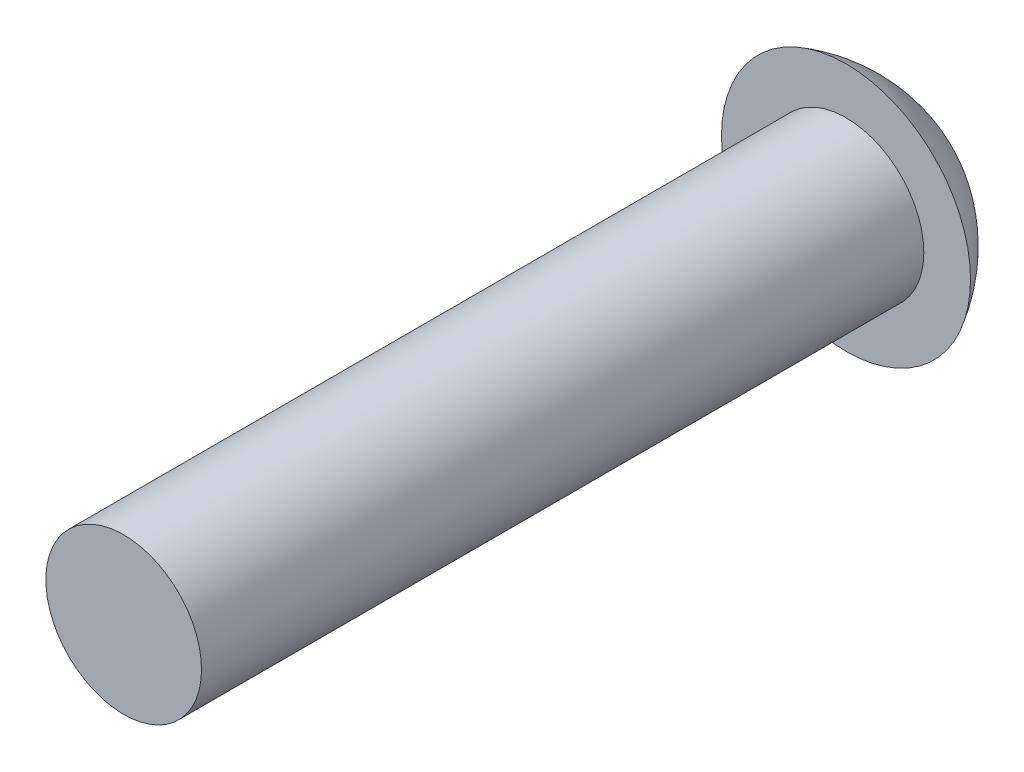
ISO-10303-21;
HEADER;
FILE_DESCRIPTION(('STEP AP214'),'2;1');
FILE_NAME('part.step','',(''),(''),'','','');
FILE_SCHEMA(('AUTOMOTIVE_DESIGN { 1 0 10303 214 1 1 1 1 }'));
ENDSEC;
DATA;
#1=APPLICATION_CONTEXT('core data for automotive mechanical design processes');
#2=APPLICATION_PROTOCOL_DEFINITION('international standard','automotive_design',2000,#1);
#3=PRODUCT_CONTEXT('',#1,'mechanical');
#4=PRODUCT('Part','Part','',(#3));
#5=PRODUCT_RELATED_PRODUCT_CATEGORY('part','',(#4));
#6=PRODUCT_DEFINITION_FORMATION('','',#4);
#7=PRODUCT_DEFINITION_CONTEXT('part definition',#1,'design');
#8=PRODUCT_DEFINITION('design','',#6,#7);
#9=PRODUCT_DEFINITION_SHAPE('','',#8);
#10=(LENGTH_UNIT() NAMED_UNIT(*) SI_UNIT(.MILLI.,.METRE.));
#11=(NAMED_UNIT(*) PLANE_ANGLE_UNIT() SI_UNIT($,.RADIAN.));
#12=(NAMED_UNIT(*) SI_UNIT($,.STERADIAN.) SOLID_ANGLE_UNIT());
#13=UNCERTAINTY_MEASURE_WITH_UNIT(LENGTH_MEASURE(1.E-05),#10,'distance_accuracy_value','');
#14=(GEOMETRIC_REPRESENTATION_CONTEXT(3) GLOBAL_UNCERTAINTY_ASSIGNED_CONTEXT((#13)) GLOBAL_UNIT_ASSIGNED_CONTEXT((#10,
#11,#12)) REPRESENTATION_CONTEXT('',''));
#15=CARTESIAN_POINT('',(0.,0.,0.));
#16=DIRECTION('',(0.,0.,1.));
#17=DIRECTION('',(1.,0.,0.));
#18=AXIS2_PLACEMENT_3D('',#15,#16,#17);
#19=CARTESIAN_POINT('',(0.,0.,11.6));
#20=DIRECTION('',(0.,0.,-1.));
#21=DIRECTION('',(-1.,0.,0.));
#22=AXIS2_PLACEMENT_3D('',#19,#20,#21);
#23=CYLINDRICAL_SURFACE('',#22,2.5);
#24=DIRECTION('',(0.,0.,-1.));
#25=VECTOR('',#24,1.);
#26=CARTESIAN_POINT('',(-2.29128784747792,1.,11.6));
#27=LINE('',#26,#25);
#28=CARTESIAN_POINT('',(-2.29128784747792,1.,-5.));
#29=VERTEX_POINT('',#28);
#30=CARTESIAN_POINT('',(-2.29128784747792,1.,5.));
#31=VERTEX_POINT('',#30);
#32=EDGE_CURVE('E47',#29,#31,#27,.F.);
#33=ORIENTED_EDGE('',*,*,#32,.T.);
#34=CARTESIAN_POINT('',(-2.29128784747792,1.,5.));
#35=CARTESIAN_POINT('',(-2.29128430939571,1.00000116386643,5.02691038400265));
#36=CARTESIAN_POINT('',(-2.29176252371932,0.998913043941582,5.05380656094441));
#37=CARTESIAN_POINT('',(-2.29364713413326,0.994580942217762,5.10738192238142));
#38=CARTESIAN_POINT('',(-2.29505317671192,0.991337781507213,5.13406118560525));
#39=CARTESIAN_POINT('',(-2.30059288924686,0.978449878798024,5.21326756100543));
#40=CARTESIAN_POINT('',(-2.30604882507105,0.965646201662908,5.26522483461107));
#41=CARTESIAN_POINT('',(-2.31979763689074,0.932127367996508,5.36600845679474));
#42=CARTESIAN_POINT('',(-2.32808756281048,0.911420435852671,5.41483799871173));
#43=CARTESIAN_POINT('',(-2.34656153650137,0.862742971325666,5.50838689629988));
#44=CARTESIAN_POINT('',(-2.35674738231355,0.834765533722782,5.55310228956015));
#45=CARTESIAN_POINT('',(-2.37850508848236,0.770658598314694,5.63963433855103));
#46=CARTESIAN_POINT('',(-2.39012125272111,0.734184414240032,5.68118445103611));
#47=CARTESIAN_POINT('',(-2.41306392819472,0.65484838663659,5.75776929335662));
#48=CARTESIAN_POINT('',(-2.42439037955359,0.611985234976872,5.79280268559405));
#49=CARTESIAN_POINT('',(-2.44601709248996,0.519002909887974,5.85670343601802));
#50=CARTESIAN_POINT('',(-2.45625912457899,0.468663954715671,5.88527246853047));
#51=CARTESIAN_POINT('',(-2.47401971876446,0.363412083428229,5.93342197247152));
#52=CARTESIAN_POINT('',(-2.48153941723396,0.308501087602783,5.95300619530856));
#53=CARTESIAN_POINT('',(-2.49269157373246,0.198483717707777,5.98167061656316));
#54=CARTESIAN_POINT('',(-2.49649461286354,0.143515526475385,5.99121347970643));
#55=CARTESIAN_POINT('',(-2.50040155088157,0.0326342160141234,6.00101423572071));
#56=CARTESIAN_POINT('',(-2.50050676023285,-0.0232785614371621,6.001275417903));
#57=CARTESIAN_POINT('',(-2.49710980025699,-0.131116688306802,5.99275858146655));
#58=CARTESIAN_POINT('',(-2.49380992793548,-0.183089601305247,5.98448747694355));
#59=CARTESIAN_POINT('',(-2.48424635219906,-0.28483739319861,5.96000328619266));
#60=CARTESIAN_POINT('',(-2.47798248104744,-0.334612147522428,5.94378975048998));
#61=CARTESIAN_POINT('',(-2.46298415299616,-0.431448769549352,5.9036818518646));
#62=CARTESIAN_POINT('',(-2.45421387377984,-0.478458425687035,5.87967537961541));
#63=CARTESIAN_POINT('',(-2.43507301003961,-0.567903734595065,5.82476770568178));
#64=CARTESIAN_POINT('',(-2.42470186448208,-0.610337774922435,5.79386408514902));
#65=CARTESIAN_POINT('',(-2.40260891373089,-0.692381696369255,5.72367790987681));
#66=CARTESIAN_POINT('',(-2.39084313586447,-0.731623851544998,5.68397876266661));
#67=CARTESIAN_POINT('',(-2.3678097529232,-0.803049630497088,5.59850995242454));
#68=CARTESIAN_POINT('',(-2.3565423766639,-0.835230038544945,5.55273753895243));
#69=CARTESIAN_POINT('',(-2.33547844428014,-0.89246828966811,5.45476485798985));
#70=CARTESIAN_POINT('',(-2.32573351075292,-0.917294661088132,5.40241758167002));
#71=CARTESIAN_POINT('',(-2.3094305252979,-0.957606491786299,5.29381923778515));
#72=CARTESIAN_POINT('',(-2.30286683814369,-0.973108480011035,5.23757527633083));
#73=CARTESIAN_POINT('',(-2.29604151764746,-0.989052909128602,5.15062818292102));
#74=CARTESIAN_POINT('',(-2.29426718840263,-0.993152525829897,5.12067122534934));
#75=CARTESIAN_POINT('',(-2.29188770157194,-0.998626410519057,5.06048249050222));
#76=CARTESIAN_POINT('',(-2.29128182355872,-1.00000235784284,5.03025089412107));
#77=CARTESIAN_POINT('',(-2.29128784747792,-1.,5.));
#78=B_SPLINE_CURVE_WITH_KNOTS('',3,(#34,#35,#36,#37,#38,#39,#40,#41,#42,#43,#44,#45,#46,#47,#48,
#49,#50,#51,#52,#53,#54,#55,#56,#57,#58,#59,#60,#61,#62,#63,#64,#65,#66,#67,#68,#69,#70,#71,#72,
#73,#74,#75,#76,#77),.UNSPECIFIED.,.F.,.F.,(4,2,2,2,2,2,2,2,2,2,2,2,2,2,2,2,2,2,2,2,2,4),(0.,
0.0806774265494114,0.161324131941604,0.321843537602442,0.482196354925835,0.642702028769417,
0.811445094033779,0.980222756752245,1.15566914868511,1.3310422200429,1.49792423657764,
1.66474711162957,1.82219943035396,1.97966066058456,2.13949573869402,2.29938695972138,
2.46976422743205,2.64021892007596,2.8155760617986,2.99062143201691,3.08135581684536,
3.17203424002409),.UNSPECIFIED.);
#79=CARTESIAN_POINT('',(-2.29128784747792,-1.,5.));
#80=VERTEX_POINT('',#79);
#81=EDGE_CURVE('E11',#31,#80,#78,.T.);
#82=ORIENTED_EDGE('',*,*,#81,.T.);
#83=DIRECTION('',(0.,0.,-1.));
#84=VECTOR('',#83,1.);
#85=CARTESIAN_POINT('',(-2.29128784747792,-1.,11.6));
#86=LINE('',#85,#84);
#87=CARTESIAN_POINT('',(-2.29128784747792,-1.,-5.));
#88=VERTEX_POINT('',#87);
#89=EDGE_CURVE('E83',#80,#88,#86,.T.);
#90=ORIENTED_EDGE('',*,*,#89,.T.);
#91=CARTESIAN_POINT('',(-2.29128784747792,-0.999999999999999,-5.));
#92=CARTESIAN_POINT('',(-2.29128430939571,-1.00000116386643,-5.02691038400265));
#93=CARTESIAN_POINT('',(-2.29176252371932,-0.998913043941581,-5.05380656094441));
#94=CARTESIAN_POINT('',(-2.29364713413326,-0.994580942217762,-5.10738192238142));
#95=CARTESIAN_POINT('',(-2.29505317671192,-0.991337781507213,-5.13406118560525));
#96=CARTESIAN_POINT('',(-2.30059288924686,-0.978449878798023,-5.21326756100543));
#97=CARTESIAN_POINT('',(-2.30604882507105,-0.965646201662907,-5.26522483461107));
#98=CARTESIAN_POINT('',(-2.31979763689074,-0.932127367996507,-5.36600845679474));
#99=CARTESIAN_POINT('',(-2.32808756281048,-0.91142043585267,-5.41483799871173));
#100=CARTESIAN_POINT('',(-2.34656153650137,-0.862742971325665,-5.50838689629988));
#101=CARTESIAN_POINT('',(-2.35674738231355,-0.834765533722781,-5.55310228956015));
#102=CARTESIAN_POINT('',(-2.37850508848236,-0.770658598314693,-5.63963433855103));
#103=CARTESIAN_POINT('',(-2.39012125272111,-0.734184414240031,-5.68118445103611));
#104=CARTESIAN_POINT('',(-2.41306392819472,-0.654848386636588,-5.75776929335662));
#105=CARTESIAN_POINT('',(-2.42439037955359,-0.611985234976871,-5.79280268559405));
#106=CARTESIAN_POINT('',(-2.44601709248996,-0.519002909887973,-5.85670343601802));
#107=CARTESIAN_POINT('',(-2.45625912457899,-0.46866395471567,-5.88527246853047));
#108=CARTESIAN_POINT('',(-2.47401971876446,-0.363412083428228,-5.93342197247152));
#109=CARTESIAN_POINT('',(-2.48153941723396,-0.308501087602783,-5.95300619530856));
#110=CARTESIAN_POINT('',(-2.49269157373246,-0.198483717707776,-5.98167061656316));
#111=CARTESIAN_POINT('',(-2.49649461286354,-0.143515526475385,-5.99121347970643));
#112=CARTESIAN_POINT('',(-2.50040155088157,-0.0326342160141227,-6.00101423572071));
#113=CARTESIAN_POINT('',(-2.50050676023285,0.0232785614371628,-6.001275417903));
#114=CARTESIAN_POINT('',(-2.49710980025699,0.131116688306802,-5.99275858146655));
#115=CARTESIAN_POINT('',(-2.49380992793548,0.183089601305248,-5.98448747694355));
#116=CARTESIAN_POINT('',(-2.48424635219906,0.28483739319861,-5.96000328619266));
#117=CARTESIAN_POINT('',(-2.47798248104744,0.334612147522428,-5.94378975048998));
#118=CARTESIAN_POINT('',(-2.46298415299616,0.431448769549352,-5.9036818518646));
#119=CARTESIAN_POINT('',(-2.45421387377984,0.478458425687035,-5.87967537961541));
#120=CARTESIAN_POINT('',(-2.43507301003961,0.567903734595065,-5.82476770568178));
#121=CARTESIAN_POINT('',(-2.42470186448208,0.610337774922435,-5.79386408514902));
#122=CARTESIAN_POINT('',(-2.40260891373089,0.692381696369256,-5.72367790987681));
#123=CARTESIAN_POINT('',(-2.39084313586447,0.731623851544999,-5.68397876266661));
#124=CARTESIAN_POINT('',(-2.3678097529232,0.803049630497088,-5.59850995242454));
#125=CARTESIAN_POINT('',(-2.3565423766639,0.835230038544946,-5.55273753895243));
#126=CARTESIAN_POINT('',(-2.33547844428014,0.892468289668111,-5.45476485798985));
#127=CARTESIAN_POINT('',(-2.32573351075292,0.917294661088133,-5.40241758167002));
#128=CARTESIAN_POINT('',(-2.3094305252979,0.9576064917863,-5.29381923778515));
#129=CARTESIAN_POINT('',(-2.30286683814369,0.973108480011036,-5.23757527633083));
#130=CARTESIAN_POINT('',(-2.29604151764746,0.989052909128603,-5.15062818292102));
#131=CARTESIAN_POINT('',(-2.29426718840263,0.993152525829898,-5.12067122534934));
#132=CARTESIAN_POINT('',(-2.29188770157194,0.998626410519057,-5.06048249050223));
#133=CARTESIAN_POINT('',(-2.29128182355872,1.00000235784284,-5.03025089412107));
#134=CARTESIAN_POINT('',(-2.29128784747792,1.,-5.));
#135=B_SPLINE_CURVE_WITH_KNOTS('',3,(#91,#92,#93,#94,#95,#96,#97,#98,#99,#100,#101,#102,#103,
#104,#105,#106,#107,#108,#109,#110,#111,#112,#113,#114,#115,#116,#117,#118,#119,#120,#121,#122,
#123,#124,#125,#126,#127,#128,#129,#130,#131,#132,#133,#134),.UNSPECIFIED.,.F.,.F.,(4,2,2,2,2,2,
2,2,2,2,2,2,2,2,2,2,2,2,2,2,2,4),(0.,0.0806774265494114,0.161324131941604,0.321843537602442,
0.482196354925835,0.642702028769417,0.81144509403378,0.980222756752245,1.15566914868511,
1.3310422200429,1.49792423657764,1.66474711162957,1.82219943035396,1.97966066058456,
2.13949573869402,2.29938695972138,2.46976422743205,2.64021892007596,2.8155760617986,
2.99062143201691,3.08135581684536,3.17203424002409),.UNSPECIFIED.);
#136=EDGE_CURVE('E119',#88,#29,#135,.T.);
#137=ORIENTED_EDGE('',*,*,#136,.T.);
#138=EDGE_LOOP('',(#33,#82,#90,#137));
#139=FACE_BOUND('',#138,.T.);
#140=CARTESIAN_POINT('',(0.,0.,11.6));
#141=DIRECTION('',(0.,0.,1.));
#142=DIRECTION('',(1.,0.,0.));
#143=AXIS2_PLACEMENT_3D('',#140,#141,#142);
#144=CIRCLE('',#143,2.5);
#145=CARTESIAN_POINT('',(2.5,0.,11.6));
#146=VERTEX_POINT('',#145);
#147=EDGE_CURVE('E113',#146,#146,#144,.T.);
#148=ORIENTED_EDGE('',*,*,#147,.F.);
#149=EDGE_LOOP('',(#148));
#150=FACE_BOUND('',#149,.T.);
#151=CARTESIAN_POINT('',(0.,0.,-11.6));
#152=DIRECTION('',(0.,0.,1.));
#153=DIRECTION('',(1.,0.,0.));
#154=AXIS2_PLACEMENT_3D('',#151,#152,#153);
#155=CIRCLE('',#154,2.5);
#156=CARTESIAN_POINT('',(2.5,0.,-11.6));
#157=VERTEX_POINT('',#156);
#158=EDGE_CURVE('E112',#157,#157,#155,.T.);
#159=ORIENTED_EDGE('',*,*,#158,.T.);
#160=EDGE_LOOP('',(#159));
#161=FACE_BOUND('',#160,.T.);
#162=ADVANCED_FACE('F34',(#139,#150,#161),#23,.T.);
#163=CARTESIAN_POINT('',(0.,0.,11.6));
#164=DIRECTION('',(0.,0.,1.));
#165=DIRECTION('',(1.,0.,0.));
#166=AXIS2_PLACEMENT_3D('',#163,#164,#165);
#167=PLANE('',#166);
#168=ORIENTED_EDGE('',*,*,#147,.T.);
#169=EDGE_LOOP('',(#168));
#170=FACE_BOUND('',#169,.T.);
#171=ADVANCED_FACE('F144',(#170),#167,.T.);
#172=CARTESIAN_POINT('',(0.,0.,-11.6));
#173=DIRECTION('',(0.,0.,-1.));
#174=DIRECTION('',(-1.,0.,0.));
#175=AXIS2_PLACEMENT_3D('',#172,#173,#174);
#176=PLANE('',#175);
#177=ORIENTED_EDGE('',*,*,#158,.F.);
#178=EDGE_LOOP('',(#177));
#179=FACE_BOUND('',#178,.T.);
#180=CARTESIAN_POINT('',(0.,0.,-11.6));
#181=DIRECTION('',(0.,0.,1.));
#182=DIRECTION('',(1.,0.,0.));
#183=AXIS2_PLACEMENT_3D('',#180,#181,#182);
#184=CIRCLE('',#183,4.);
#185=CARTESIAN_POINT('',(4.,0.,-11.6));
#186=VERTEX_POINT('',#185);
#187=EDGE_CURVE('E106',#186,#186,#184,.T.);
#188=ORIENTED_EDGE('',*,*,#187,.T.);
#189=EDGE_LOOP('',(#188));
#190=FACE_BOUND('',#189,.T.);
#191=ADVANCED_FACE('F141',(#179,#190),#176,.F.);
#192=CARTESIAN_POINT('',(-0.33665827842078,0.,-9.11134675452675));
#193=DIRECTION('',(0.,-1.,0.));
#194=DIRECTION('',(1.,0.,0.));
#195=AXIS2_PLACEMENT_3D('',#192,#193,#194);
#196=CIRCLE('',#195,5.);
#197=TRIMMED_CURVE('',#196,(PARAMETER_VALUE(-1.50341369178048)),
(PARAMETER_VALUE(1.50341369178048)),.T.,.PARAMETER.);
#198=CARTESIAN_POINT('',(0.,0.,-9.11134675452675));
#199=DIRECTION('',(0.,0.,1.));
#200=AXIS1_PLACEMENT('',#198,#199);
#201=SURFACE_OF_REVOLUTION('',#197,#200);
#202=ORIENTED_EDGE('',*,*,#187,.F.);
#203=EDGE_LOOP('',(#202));
#204=FACE_BOUND('',#203,.T.);
#205=CARTESIAN_POINT('',(0.,0.,-14.1));
#206=VERTEX_POINT('',#205);
#207=VERTEX_LOOP('',#206);
#208=FACE_BOUND('',#207,.T.);
#209=ADVANCED_FACE('F138',(#204,#208),#201,.T.);
#210=CARTESIAN_POINT('',(-23.5,0.,5.));
#211=DIRECTION('',(1.,0.,0.));
#212=DIRECTION('',(0.,0.,-1.));
#213=AXIS2_PLACEMENT_3D('',#210,#211,#212);
#214=CYLINDRICAL_SURFACE('',#213,1.);
#215=DIRECTION('',(1.,0.,0.));
#216=VECTOR('',#215,1.);
#217=CARTESIAN_POINT('',(-23.5,1.,5.));
#218=LINE('',#217,#216);
#219=CARTESIAN_POINT('',(-1.5,1.,5.));
#220=VERTEX_POINT('',#219);
#221=EDGE_CURVE('E100',#31,#220,#218,.T.);
#222=ORIENTED_EDGE('',*,*,#221,.T.);
#223=CARTESIAN_POINT('',(-1.5,0.,5.));
#224=DIRECTION('',(1.,0.,0.));
#225=DIRECTION('',(0.,0.,-1.));
#226=AXIS2_PLACEMENT_3D('',#223,#224,#225);
#227=CIRCLE('',#226,1.);
#228=CARTESIAN_POINT('',(-1.5,-1.,5.));
#229=VERTEX_POINT('',#228);
#230=EDGE_CURVE('E93',#220,#229,#227,.T.);
#231=ORIENTED_EDGE('',*,*,#230,.T.);
#232=DIRECTION('',(1.,0.,0.));
#233=VECTOR('',#232,1.);
#234=CARTESIAN_POINT('',(-23.5,-1.,5.));
#235=LINE('',#234,#233);
#236=EDGE_CURVE('E78',#80,#229,#235,.T.);
#237=ORIENTED_EDGE('',*,*,#236,.F.);
#238=ORIENTED_EDGE('',*,*,#81,.F.);
#239=EDGE_LOOP('',(#222,#231,#237,#238));
#240=FACE_BOUND('',#239,.T.);
#241=ADVANCED_FACE('F98',(#240),#214,.F.);
#242=CARTESIAN_POINT('',(-23.5,1.,5.));
#243=DIRECTION('',(0.,1.,0.));
#244=DIRECTION('',(0.,0.,1.));
#245=AXIS2_PLACEMENT_3D('',#242,#243,#244);
#246=PLANE('',#245);
#247=DIRECTION('',(1.,0.,0.));
#248=VECTOR('',#247,1.);
#249=CARTESIAN_POINT('',(-23.5,1.,-5.));
#250=LINE('',#249,#248);
#251=CARTESIAN_POINT('',(-1.5,1.,-5.));
#252=VERTEX_POINT('',#251);
#253=EDGE_CURVE('E107',#29,#252,#250,.T.);
#254=ORIENTED_EDGE('',*,*,#253,.T.);
#255=DIRECTION('',(0.,0.,1.));
#256=VECTOR('',#255,1.);
#257=CARTESIAN_POINT('',(-1.5,1.,5.));
#258=LINE('',#257,#256);
#259=EDGE_CURVE('E86',#252,#220,#258,.T.);
#260=ORIENTED_EDGE('',*,*,#259,.T.);
#261=ORIENTED_EDGE('',*,*,#221,.F.);
#262=ORIENTED_EDGE('',*,*,#32,.F.);
#263=EDGE_LOOP('',(#254,#260,#261,#262));
#264=FACE_BOUND('',#263,.T.);
#265=ADVANCED_FACE('F131',(#264),#246,.F.);
#266=CARTESIAN_POINT('',(-23.5,0.,-5.));
#267=DIRECTION('',(1.,0.,0.));
#268=DIRECTION('',(0.,0.,-1.));
#269=AXIS2_PLACEMENT_3D('',#266,#267,#268);
#270=CYLINDRICAL_SURFACE('',#269,1.);
#271=DIRECTION('',(1.,0.,0.));
#272=VECTOR('',#271,1.);
#273=CARTESIAN_POINT('',(-23.5,-0.999999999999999,-5.));
#274=LINE('',#273,#272);
#275=CARTESIAN_POINT('',(-1.5,-0.999999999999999,-5.));
#276=VERTEX_POINT('',#275);
#277=EDGE_CURVE('E54',#88,#276,#274,.T.);
#278=ORIENTED_EDGE('',*,*,#277,.T.);
#279=CARTESIAN_POINT('',(-1.5,0.,-5.));
#280=DIRECTION('',(1.,0.,0.));
#281=DIRECTION('',(0.,0.,-1.));
#282=AXIS2_PLACEMENT_3D('',#279,#280,#281);
#283=CIRCLE('',#282,1.);
#284=EDGE_CURVE('E96',#276,#252,#283,.T.);
#285=ORIENTED_EDGE('',*,*,#284,.T.);
#286=ORIENTED_EDGE('',*,*,#253,.F.);
#287=ORIENTED_EDGE('',*,*,#136,.F.);
#288=EDGE_LOOP('',(#278,#285,#286,#287));
#289=FACE_BOUND('',#288,.T.);
#290=ADVANCED_FACE('F126',(#289),#270,.F.);
#291=CARTESIAN_POINT('',(-23.5,-1.,5.));
#292=DIRECTION('',(0.,-1.,0.));
#293=DIRECTION('',(0.,0.,-1.));
#294=AXIS2_PLACEMENT_3D('',#291,#292,#293);
#295=PLANE('',#294);
#296=ORIENTED_EDGE('',*,*,#236,.T.);
#297=DIRECTION('',(0.,0.,-1.));
#298=VECTOR('',#297,1.);
#299=CARTESIAN_POINT('',(-1.5,-1.,5.));
#300=LINE('',#299,#298);
#301=EDGE_CURVE('E81',#229,#276,#300,.T.);
#302=ORIENTED_EDGE('',*,*,#301,.T.);
#303=ORIENTED_EDGE('',*,*,#277,.F.);
#304=ORIENTED_EDGE('',*,*,#89,.F.);
#305=EDGE_LOOP('',(#296,#302,#303,#304));
#306=FACE_BOUND('',#305,.T.);
#307=ADVANCED_FACE('F80',(#306),#295,.F.);
#308=CARTESIAN_POINT('',(-1.5,0.,5.));
#309=DIRECTION('',(1.,0.,0.));
#310=DIRECTION('',(0.,0.,-1.));
#311=AXIS2_PLACEMENT_3D('',#308,#309,#310);
#312=PLANE('',#311);
#313=ORIENTED_EDGE('',*,*,#230,.F.);
#314=ORIENTED_EDGE('',*,*,#259,.F.);
#315=ORIENTED_EDGE('',*,*,#284,.F.);
#316=ORIENTED_EDGE('',*,*,#301,.F.);
#317=EDGE_LOOP('',(#313,#314,#315,#316));
#318=FACE_BOUND('',#317,.T.);
#319=ADVANCED_FACE('F91',(#318),#312,.F.);
#320=CLOSED_SHELL('',(#162,#171,#191,#209,#241,#265,#290,#307,#319));
#321=MANIFOLD_SOLID_BREP('B2',#320);
#322=ADVANCED_BREP_SHAPE_REPRESENTATION('',(#18,#321),#14);
#323=SHAPE_DEFINITION_REPRESENTATION(#9,#322);
ENDSEC;
END-ISO-10303-21;
